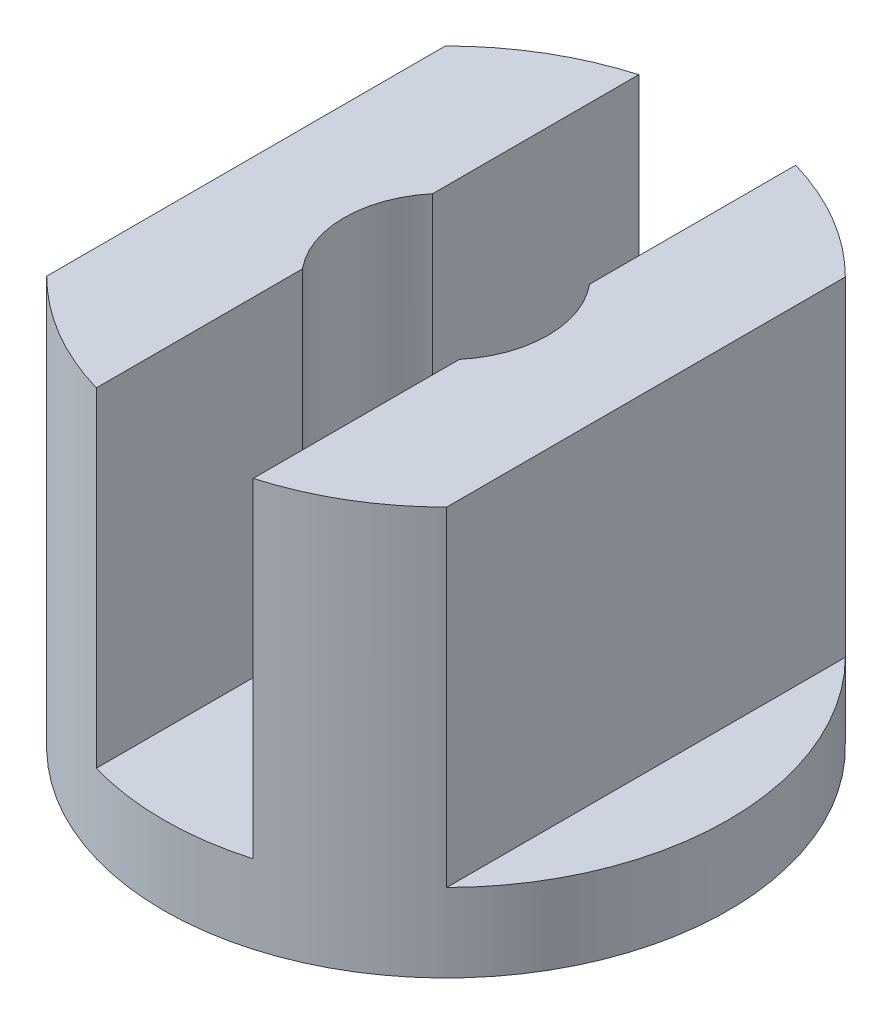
from build123d import *

# Parameters (mm, degrees)
SKETCH_1_R               = 72
EXTRUDE_1_DEPTH          = 20
EXTRUDE_2_DEPTH          = 51
EXTRUDE_2_DEPTH_BACK     = 51
SKETCH_2_W               = 150
SKETCH_2_H               = 84
CUT_EXTRUDE_1_DEPTH      = 148.054411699
CUT_EXTRUDE_1_DEPTH_BACK = 148.054411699
SKETCH_3_W               = 40
SKETCH_3_H               = 84
CUT_EXTRUDE_3_DEPTH      = 134.66001646
CUT_EXTRUDE_3_DEPTH_BACK = 134.66001646
SKETCH_5_R               = 26
CUT_EXTRUDE_6_DEPTH      = 148.054411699
CUT_EXTRUDE_6_DEPTH_BACK = 10
SKETCH_6_OUTSIDE_W       = 192.498
SKETCH_6_OUTSIDE_H       = 198.498
SKETCH_6_OUTSIDE_R       = 72


with BuildPart() as part:
    # Sketch 1 → Extrude 1 (new body)
    with BuildSketch(Plane(origin=(0, 0, 0), x_dir=(1, 0, 0), z_dir=(0, 1, 0))):
        with Locations(Location((0, 0, 0), (0, 0, 270))):
            Circle(SKETCH_1_R)
    extrude(amount=EXTRUDE_1_DEPTH)

    # Sketch 2 → Extrude 2 (add, two sides: drawn at the far end of the back side and taken through both)
    with BuildSketch(Plane(origin=(0, 0, 0), x_dir=(0, 0, -1), z_dir=(1, 0, 0)).offset(-EXTRUDE_2_DEPTH_BACK)):
        with Locations((0, 62)):
            Rectangle(SKETCH_2_W, SKETCH_2_H)
    extrude(amount=EXTRUDE_2_DEPTH + EXTRUDE_2_DEPTH_BACK)

    # Sketch 3 → Cut-Extrude 1 (cut, two sides: drawn at the far end of the back side and taken through both)
    with BuildSketch(Plane.XY.offset(-CUT_EXTRUDE_1_DEPTH_BACK)):
        with Locations((0, 62)):
            Rectangle(SKETCH_3_W, SKETCH_3_H)
    extrude(amount=CUT_EXTRUDE_1_DEPTH + CUT_EXTRUDE_1_DEPTH_BACK, mode=Mode.SUBTRACT)

    # Sketch 5 → Cut-Extrude 3 (cut, two sides: drawn at the far end of the back side and taken through both)
    with BuildSketch(Plane(origin=(0, 20, 0), x_dir=(1, 0, 0), z_dir=(0, 1, 0)).offset(-CUT_EXTRUDE_3_DEPTH_BACK)):
        with Locations(Location((0, 0, 0), (0, 0, 270))):
            Circle(SKETCH_5_R)
    extrude(amount=CUT_EXTRUDE_3_DEPTH + CUT_EXTRUDE_3_DEPTH_BACK, mode=Mode.SUBTRACT)

    # Sketch 6 outside → Cut-Extrude 6 (cut, two sides: drawn at the far end of the back side and taken through both)
    with BuildSketch(Plane(origin=(0, 0, 0), x_dir=(1, 0, 0), z_dir=(0, 1, 0)).offset(-CUT_EXTRUDE_6_DEPTH_BACK)):
        Rectangle(SKETCH_6_OUTSIDE_W, SKETCH_6_OUTSIDE_H)
        with Locations(Location((0, 0, 0), (0, 0, 73.872379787))):
            Circle(SKETCH_6_OUTSIDE_R, mode=Mode.SUBTRACT)
    extrude(amount=CUT_EXTRUDE_6_DEPTH + CUT_EXTRUDE_6_DEPTH_BACK, mode=Mode.SUBTRACT)


solid = part.part
